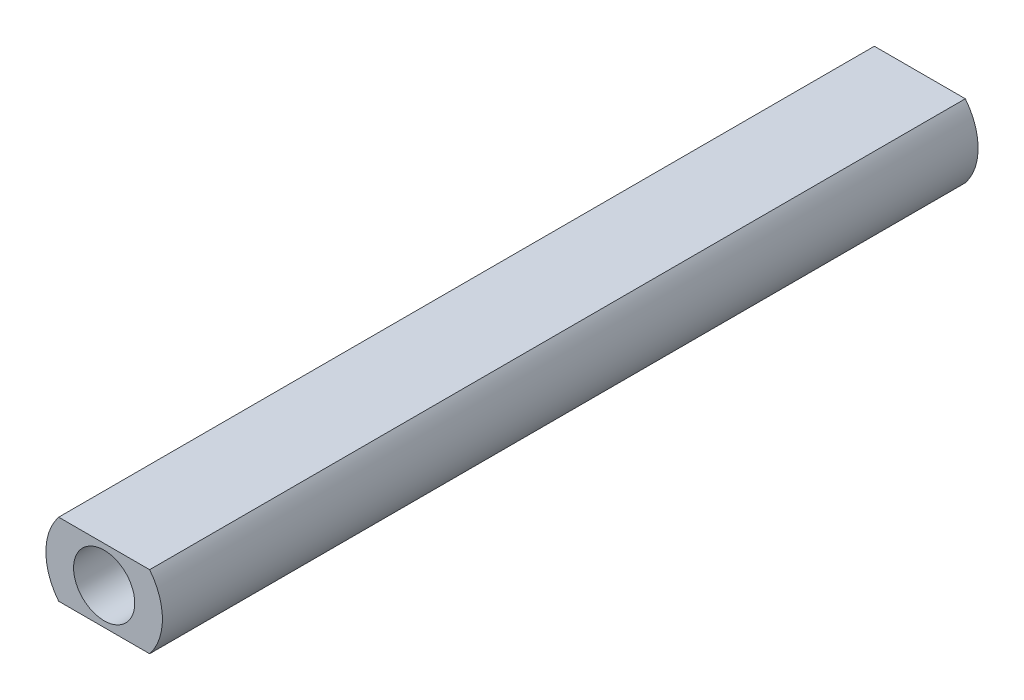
from build123d import *

# Parameters (mm, degrees)
ESQUISSE1_R             = 4
EXTRUSION1_DEPTH        = 28
TROU_TARAUD_M51_D       = 4.2
TROU_TARAUD_M51_DEPTH   = 14.4
TROU_TARAUD_M51_TIP     = 1.2618073
ESQUISSE4_W             = 9.8271431
ESQUISSE4_H             = 2.273100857
ESQUISSE4_W_2           = 9.507129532
ESQUISSE4_H_2           = 3.04228145
ENL_V_MAT_EXTRU_1_DEPTH = 29.565713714


with BuildPart() as part:
    # Esquisse1 → Extrusion1 (new body)
    with BuildSketch(Plane.XY):
        Circle(ESQUISSE1_R)
    extrude(amount=EXTRUSION1_DEPTH)

    # Trou taraud_ M51
    with Locations(Plane.XY.offset(28)):
        with Locations((0, 0)):
            Hole(TROU_TARAUD_M51_D / 2, depth=TROU_TARAUD_M51_DEPTH)
            with Locations((0, 0, -(TROU_TARAUD_M51_DEPTH + TROU_TARAUD_M51_TIP / 2))):  # 118° drill point
                Cone(0, TROU_TARAUD_M51_D / 2, TROU_TARAUD_M51_TIP, mode=Mode.SUBTRACT)

    # Esquisse4 → Enl_v. mat.-Extru.1 (cut, through all)
    with BuildSketch(Plane.XY):
        with Locations((-0.252566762, 3.636550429)):
            Rectangle(ESQUISSE4_W, ESQUISSE4_H)
        with Locations((0.5638487, -4.021140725)):
            Rectangle(ESQUISSE4_W_2, ESQUISSE4_H_2)
    extrude(amount=ENL_V_MAT_EXTRU_1_DEPTH, mode=Mode.SUBTRACT)

    # Sym_trie1: part across plane


with BuildPart() as part_1:
    add(part.part)
    add(part.part.mirror(Plane.XY))


solid = part_1.part
